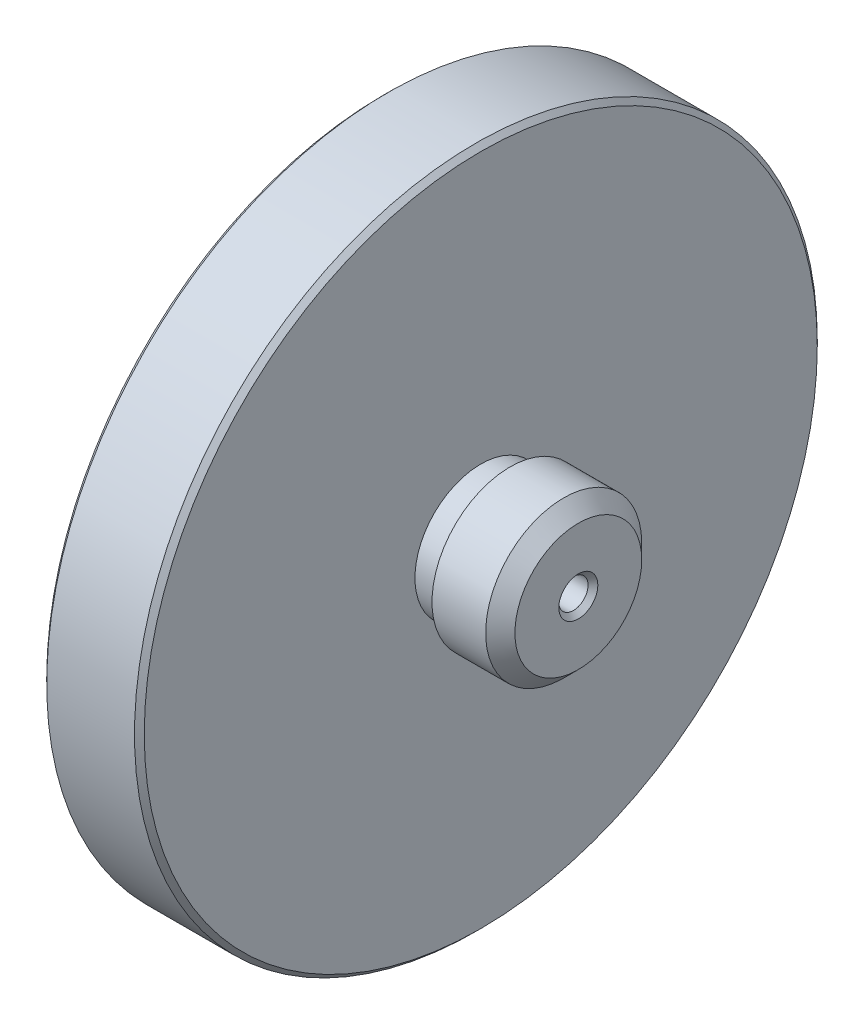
ISO-10303-21;
HEADER;
FILE_DESCRIPTION(('STEP AP214'),'2;1');
FILE_NAME('part.step','',(''),(''),'','','');
FILE_SCHEMA(('AUTOMOTIVE_DESIGN { 1 0 10303 214 1 1 1 1 }'));
ENDSEC;
DATA;
#1=APPLICATION_CONTEXT('core data for automotive mechanical design processes');
#2=APPLICATION_PROTOCOL_DEFINITION('international standard','automotive_design',2000,#1);
#3=PRODUCT_CONTEXT('',#1,'mechanical');
#4=PRODUCT('Part','Part','',(#3));
#5=PRODUCT_RELATED_PRODUCT_CATEGORY('part','',(#4));
#6=PRODUCT_DEFINITION_FORMATION('','',#4);
#7=PRODUCT_DEFINITION_CONTEXT('part definition',#1,'design');
#8=PRODUCT_DEFINITION('design','',#6,#7);
#9=PRODUCT_DEFINITION_SHAPE('','',#8);
#10=(LENGTH_UNIT() NAMED_UNIT(*) SI_UNIT(.MILLI.,.METRE.));
#11=(NAMED_UNIT(*) PLANE_ANGLE_UNIT() SI_UNIT($,.RADIAN.));
#12=(NAMED_UNIT(*) SI_UNIT($,.STERADIAN.) SOLID_ANGLE_UNIT());
#13=UNCERTAINTY_MEASURE_WITH_UNIT(LENGTH_MEASURE(1.E-05),#10,'distance_accuracy_value','');
#14=(GEOMETRIC_REPRESENTATION_CONTEXT(3) GLOBAL_UNCERTAINTY_ASSIGNED_CONTEXT((#13)) GLOBAL_UNIT_ASSIGNED_CONTEXT((#10,
#11,#12)) REPRESENTATION_CONTEXT('',''));
#15=CARTESIAN_POINT('',(0.,0.,0.));
#16=DIRECTION('',(0.,0.,1.));
#17=DIRECTION('',(1.,0.,0.));
#18=AXIS2_PLACEMENT_3D('',#15,#16,#17);
#19=CARTESIAN_POINT('',(0.,0.,0.));
#20=DIRECTION('',(1.,0.,0.));
#21=DIRECTION('',(0.,0.,-1.));
#22=AXIS2_PLACEMENT_3D('',#19,#20,#21);
#23=CYLINDRICAL_SURFACE('',#22,4.375);
#24=CARTESIAN_POINT('',(0.500000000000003,0.,0.));
#25=DIRECTION('',(1.,0.,0.));
#26=DIRECTION('',(0.,0.,-1.));
#27=AXIS2_PLACEMENT_3D('',#24,#25,#26);
#28=CIRCLE('',#27,4.375);
#29=CARTESIAN_POINT('',(0.500000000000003,0.,-4.375));
#30=VERTEX_POINT('',#29);
#31=EDGE_CURVE('E73',#30,#30,#28,.F.);
#32=ORIENTED_EDGE('',*,*,#31,.T.);
#33=EDGE_LOOP('',(#32));
#34=FACE_BOUND('',#33,.T.);
#35=CARTESIAN_POINT('',(16.,0.,0.));
#36=DIRECTION('',(1.,0.,0.));
#37=DIRECTION('',(0.,0.,-1.));
#38=AXIS2_PLACEMENT_3D('',#35,#36,#37);
#39=CIRCLE('',#38,4.375);
#40=CARTESIAN_POINT('',(16.,0.,-4.375));
#41=VERTEX_POINT('',#40);
#42=EDGE_CURVE('E50',#41,#41,#39,.F.);
#43=ORIENTED_EDGE('',*,*,#42,.F.);
#44=EDGE_LOOP('',(#43));
#45=FACE_BOUND('',#44,.T.);
#46=ADVANCED_FACE('F30',(#34,#45),#23,.F.);
#47=CARTESIAN_POINT('',(10.,0.,0.));
#48=DIRECTION('',(1.,0.,0.));
#49=DIRECTION('',(0.,0.,-1.));
#50=AXIS2_PLACEMENT_3D('',#47,#48,#49);
#51=PLANE('',#50);
#52=CARTESIAN_POINT('',(10.,0.,0.));
#53=DIRECTION('',(1.,0.,0.));
#54=DIRECTION('',(0.,0.,-1.));
#55=AXIS2_PLACEMENT_3D('',#52,#53,#54);
#56=CIRCLE('',#55,34.5);
#57=CARTESIAN_POINT('',(10.,0.,-34.5));
#58=VERTEX_POINT('',#57);
#59=EDGE_CURVE('E59',#58,#58,#56,.T.);
#60=ORIENTED_EDGE('',*,*,#59,.T.);
#61=EDGE_LOOP('',(#60));
#62=FACE_BOUND('',#61,.T.);
#63=CARTESIAN_POINT('',(10.,0.,0.));
#64=DIRECTION('',(1.,0.,0.));
#65=DIRECTION('',(0.,0.,-1.));
#66=AXIS2_PLACEMENT_3D('',#63,#64,#65);
#67=CIRCLE('',#66,6.75);
#68=CARTESIAN_POINT('',(10.,0.,-6.75));
#69=VERTEX_POINT('',#68);
#70=EDGE_CURVE('E81',#69,#69,#67,.T.);
#71=ORIENTED_EDGE('',*,*,#70,.F.);
#72=EDGE_LOOP('',(#71));
#73=FACE_BOUND('',#72,.T.);
#74=ADVANCED_FACE('F97',(#62,#73),#51,.T.);
#75=CARTESIAN_POINT('',(10.,0.,0.));
#76=DIRECTION('',(-1.,0.,0.));
#77=DIRECTION('',(0.,0.,1.));
#78=AXIS2_PLACEMENT_3D('',#75,#76,#77);
#79=CYLINDRICAL_SURFACE('',#78,35.);
#80=CARTESIAN_POINT('',(0.500000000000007,0.,0.));
#81=DIRECTION('',(1.,0.,0.));
#82=DIRECTION('',(0.,0.,-1.));
#83=AXIS2_PLACEMENT_3D('',#80,#81,#82);
#84=CIRCLE('',#83,35.);
#85=CARTESIAN_POINT('',(0.500000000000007,0.,-35.));
#86=VERTEX_POINT('',#85);
#87=EDGE_CURVE('E67',#86,#86,#84,.T.);
#88=ORIENTED_EDGE('',*,*,#87,.T.);
#89=EDGE_LOOP('',(#88));
#90=FACE_BOUND('',#89,.T.);
#91=CARTESIAN_POINT('',(9.49999999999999,0.,0.));
#92=DIRECTION('',(1.,0.,0.));
#93=DIRECTION('',(0.,0.,-1.));
#94=AXIS2_PLACEMENT_3D('',#91,#92,#93);
#95=CIRCLE('',#94,35.);
#96=CARTESIAN_POINT('',(9.49999999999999,0.,-35.));
#97=VERTEX_POINT('',#96);
#98=EDGE_CURVE('E70',#97,#97,#95,.F.);
#99=ORIENTED_EDGE('',*,*,#98,.T.);
#100=EDGE_LOOP('',(#99));
#101=FACE_BOUND('',#100,.T.);
#102=ADVANCED_FACE('F99',(#90,#101),#79,.T.);
#103=CARTESIAN_POINT('',(0.,0.,0.));
#104=DIRECTION('',(1.,0.,0.));
#105=DIRECTION('',(0.,0.,-1.));
#106=AXIS2_PLACEMENT_3D('',#103,#104,#105);
#107=PLANE('',#106);
#108=CARTESIAN_POINT('',(0.,0.,0.));
#109=DIRECTION('',(1.,0.,0.));
#110=DIRECTION('',(0.,0.,-1.));
#111=AXIS2_PLACEMENT_3D('',#108,#109,#110);
#112=CIRCLE('',#111,4.875);
#113=CARTESIAN_POINT('',(0.,0.,-4.875));
#114=VERTEX_POINT('',#113);
#115=EDGE_CURVE('E76',#114,#114,#112,.T.);
#116=ORIENTED_EDGE('',*,*,#115,.T.);
#117=EDGE_LOOP('',(#116));
#118=FACE_BOUND('',#117,.T.);
#119=CARTESIAN_POINT('',(0.,0.,0.));
#120=DIRECTION('',(1.,0.,0.));
#121=DIRECTION('',(0.,0.,-1.));
#122=AXIS2_PLACEMENT_3D('',#119,#120,#121);
#123=CIRCLE('',#122,34.5);
#124=CARTESIAN_POINT('',(0.,0.,-34.5));
#125=VERTEX_POINT('',#124);
#126=EDGE_CURVE('E63',#125,#125,#123,.F.);
#127=ORIENTED_EDGE('',*,*,#126,.T.);
#128=EDGE_LOOP('',(#127));
#129=FACE_BOUND('',#128,.T.);
#130=ADVANCED_FACE('F106',(#118,#129),#107,.F.);
#131=CARTESIAN_POINT('',(20.,0.,0.));
#132=DIRECTION('',(-1.,0.,0.));
#133=DIRECTION('',(0.,0.,1.));
#134=AXIS2_PLACEMENT_3D('',#131,#132,#133);
#135=CYLINDRICAL_SURFACE('',#134,8.);
#136=CARTESIAN_POINT('',(18.5,0.,0.));
#137=DIRECTION('',(1.,0.,0.));
#138=DIRECTION('',(0.,0.,-1.));
#139=AXIS2_PLACEMENT_3D('',#136,#137,#138);
#140=CIRCLE('',#139,8.);
#141=CARTESIAN_POINT('',(18.5,0.,-8.));
#142=VERTEX_POINT('',#141);
#143=EDGE_CURVE('E53',#142,#142,#140,.F.);
#144=ORIENTED_EDGE('',*,*,#143,.T.);
#145=EDGE_LOOP('',(#144));
#146=FACE_BOUND('',#145,.T.);
#147=CARTESIAN_POINT('',(13.,0.,0.));
#148=DIRECTION('',(1.,0.,0.));
#149=DIRECTION('',(0.,0.,-1.));
#150=AXIS2_PLACEMENT_3D('',#147,#148,#149);
#151=CIRCLE('',#150,8.);
#152=CARTESIAN_POINT('',(13.,0.,-8.));
#153=VERTEX_POINT('',#152);
#154=EDGE_CURVE('E60',#153,#153,#151,.T.);
#155=ORIENTED_EDGE('',*,*,#154,.T.);
#156=EDGE_LOOP('',(#155));
#157=FACE_BOUND('',#156,.T.);
#158=ADVANCED_FACE('F113',(#146,#157),#135,.T.);
#159=CARTESIAN_POINT('',(20.,0.,0.));
#160=DIRECTION('',(1.,0.,0.));
#161=DIRECTION('',(0.,0.,-1.));
#162=AXIS2_PLACEMENT_3D('',#159,#160,#161);
#163=PLANE('',#162);
#164=CARTESIAN_POINT('',(20.,0.,0.));
#165=DIRECTION('',(1.,0.,0.));
#166=DIRECTION('',(0.,0.,-1.));
#167=AXIS2_PLACEMENT_3D('',#164,#165,#166);
#168=CIRCLE('',#167,2.00000000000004);
#169=CARTESIAN_POINT('',(20.,0.,-2.00000000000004));
#170=VERTEX_POINT('',#169);
#171=EDGE_CURVE('E11',#170,#170,#168,.F.);
#172=ORIENTED_EDGE('',*,*,#171,.T.);
#173=EDGE_LOOP('',(#172));
#174=FACE_BOUND('',#173,.T.);
#175=CARTESIAN_POINT('',(20.,0.,0.));
#176=DIRECTION('',(1.,0.,0.));
#177=DIRECTION('',(0.,0.,-1.));
#178=AXIS2_PLACEMENT_3D('',#175,#176,#177);
#179=CIRCLE('',#178,6.50000000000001);
#180=CARTESIAN_POINT('',(20.,0.,-6.50000000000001));
#181=VERTEX_POINT('',#180);
#182=EDGE_CURVE('E56',#181,#181,#179,.T.);
#183=ORIENTED_EDGE('',*,*,#182,.T.);
#184=EDGE_LOOP('',(#183));
#185=FACE_BOUND('',#184,.T.);
#186=ADVANCED_FACE('F122',(#174,#185),#163,.T.);
#187=CARTESIAN_POINT('',(0.,0.,0.));
#188=DIRECTION('',(-1.,0.,0.));
#189=DIRECTION('',(0.,0.,1.));
#190=AXIS2_PLACEMENT_3D('',#187,#188,#189);
#191=CONICAL_SURFACE('',#190,4.875,0.785398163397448);
#192=ORIENTED_EDGE('',*,*,#31,.F.);
#193=EDGE_LOOP('',(#192));
#194=FACE_BOUND('',#193,.T.);
#195=ORIENTED_EDGE('',*,*,#115,.F.);
#196=EDGE_LOOP('',(#195));
#197=FACE_BOUND('',#196,.T.);
#198=ADVANCED_FACE('F118',(#194,#197),#191,.F.);
#199=CARTESIAN_POINT('',(0.500000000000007,0.,0.));
#200=DIRECTION('',(1.,0.,0.));
#201=DIRECTION('',(0.,0.,-1.));
#202=AXIS2_PLACEMENT_3D('',#199,#200,#201);
#203=CONICAL_SURFACE('',#202,35.,0.785398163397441);
#204=ORIENTED_EDGE('',*,*,#126,.F.);
#205=EDGE_LOOP('',(#204));
#206=FACE_BOUND('',#205,.T.);
#207=ORIENTED_EDGE('',*,*,#87,.F.);
#208=EDGE_LOOP('',(#207));
#209=FACE_BOUND('',#208,.T.);
#210=ADVANCED_FACE('F121',(#206,#209),#203,.T.);
#211=CARTESIAN_POINT('',(10.,0.,0.));
#212=DIRECTION('',(-1.,0.,0.));
#213=DIRECTION('',(0.,0.,1.));
#214=AXIS2_PLACEMENT_3D('',#211,#212,#213);
#215=CONICAL_SURFACE('',#214,34.5,0.785398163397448);
#216=ORIENTED_EDGE('',*,*,#98,.F.);
#217=EDGE_LOOP('',(#216));
#218=FACE_BOUND('',#217,.T.);
#219=ORIENTED_EDGE('',*,*,#59,.F.);
#220=EDGE_LOOP('',(#219));
#221=FACE_BOUND('',#220,.T.);
#222=ADVANCED_FACE('F126',(#218,#221),#215,.T.);
#223=CARTESIAN_POINT('',(13.,0.,0.));
#224=DIRECTION('',(1.,0.,0.));
#225=DIRECTION('',(0.,0.,-1.));
#226=AXIS2_PLACEMENT_3D('',#223,#224,#225);
#227=PLANE('',#226);
#228=CARTESIAN_POINT('',(13.,0.,0.));
#229=DIRECTION('',(1.,0.,0.));
#230=DIRECTION('',(0.,0.,-1.));
#231=AXIS2_PLACEMENT_3D('',#228,#229,#230);
#232=CIRCLE('',#231,6.75);
#233=CARTESIAN_POINT('',(13.,0.,-6.75));
#234=VERTEX_POINT('',#233);
#235=EDGE_CURVE('E64',#234,#234,#232,.T.);
#236=ORIENTED_EDGE('',*,*,#235,.T.);
#237=EDGE_LOOP('',(#236));
#238=FACE_BOUND('',#237,.T.);
#239=ORIENTED_EDGE('',*,*,#154,.F.);
#240=EDGE_LOOP('',(#239));
#241=FACE_BOUND('',#240,.T.);
#242=ADVANCED_FACE('F87',(#238,#241),#227,.F.);
#243=CARTESIAN_POINT('',(13.,0.,0.));
#244=DIRECTION('',(-1.,0.,0.));
#245=DIRECTION('',(0.,0.,1.));
#246=AXIS2_PLACEMENT_3D('',#243,#244,#245);
#247=CYLINDRICAL_SURFACE('',#246,6.75);
#248=ORIENTED_EDGE('',*,*,#235,.F.);
#249=EDGE_LOOP('',(#248));
#250=FACE_BOUND('',#249,.T.);
#251=ORIENTED_EDGE('',*,*,#70,.T.);
#252=EDGE_LOOP('',(#251));
#253=FACE_BOUND('',#252,.T.);
#254=ADVANCED_FACE('F90',(#250,#253),#247,.T.);
#255=CARTESIAN_POINT('',(20.,0.,0.));
#256=DIRECTION('',(-1.,0.,0.));
#257=DIRECTION('',(0.,0.,1.));
#258=AXIS2_PLACEMENT_3D('',#255,#256,#257);
#259=CONICAL_SURFACE('',#258,6.50000000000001,0.785398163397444);
#260=ORIENTED_EDGE('',*,*,#143,.F.);
#261=EDGE_LOOP('',(#260));
#262=FACE_BOUND('',#261,.T.);
#263=ORIENTED_EDGE('',*,*,#182,.F.);
#264=EDGE_LOOP('',(#263));
#265=FACE_BOUND('',#264,.T.);
#266=ADVANCED_FACE('F93',(#262,#265),#259,.T.);
#267=CARTESIAN_POINT('',(16.,0.,0.));
#268=DIRECTION('',(1.,0.,0.));
#269=DIRECTION('',(0.,0.,-1.));
#270=AXIS2_PLACEMENT_3D('',#267,#268,#269);
#271=PLANE('',#270);
#272=CARTESIAN_POINT('',(16.,0.,0.));
#273=DIRECTION('',(1.,0.,0.));
#274=DIRECTION('',(0.,0.,-1.));
#275=AXIS2_PLACEMENT_3D('',#272,#273,#274);
#276=CIRCLE('',#275,2.);
#277=CARTESIAN_POINT('',(16.,0.,-2.));
#278=VERTEX_POINT('',#277);
#279=EDGE_CURVE('E45',#278,#278,#276,.T.);
#280=ORIENTED_EDGE('',*,*,#279,.T.);
#281=EDGE_LOOP('',(#280));
#282=FACE_BOUND('',#281,.T.);
#283=ORIENTED_EDGE('',*,*,#42,.T.);
#284=EDGE_LOOP('',(#283));
#285=FACE_BOUND('',#284,.T.);
#286=ADVANCED_FACE('F132',(#282,#285),#271,.F.);
#287=CARTESIAN_POINT('',(16.,0.,0.));
#288=DIRECTION('',(1.,0.,0.));
#289=DIRECTION('',(0.,0.,-1.));
#290=AXIS2_PLACEMENT_3D('',#287,#288,#289);
#291=CYLINDRICAL_SURFACE('',#290,1.5);
#292=CARTESIAN_POINT('',(16.5,0.,0.));
#293=DIRECTION('',(1.,0.,0.));
#294=DIRECTION('',(0.,0.,-1.));
#295=AXIS2_PLACEMENT_3D('',#292,#293,#294);
#296=CIRCLE('',#295,1.5);
#297=CARTESIAN_POINT('',(16.5,0.,-1.5));
#298=VERTEX_POINT('',#297);
#299=EDGE_CURVE('E37',#298,#298,#296,.F.);
#300=ORIENTED_EDGE('',*,*,#299,.T.);
#301=EDGE_LOOP('',(#300));
#302=FACE_BOUND('',#301,.T.);
#303=CARTESIAN_POINT('',(19.5,0.,0.));
#304=DIRECTION('',(1.,0.,0.));
#305=DIRECTION('',(0.,0.,-1.));
#306=AXIS2_PLACEMENT_3D('',#303,#304,#305);
#307=CIRCLE('',#306,1.5);
#308=CARTESIAN_POINT('',(19.5,0.,-1.5));
#309=VERTEX_POINT('',#308);
#310=EDGE_CURVE('E41',#309,#309,#307,.T.);
#311=ORIENTED_EDGE('',*,*,#310,.T.);
#312=EDGE_LOOP('',(#311));
#313=FACE_BOUND('',#312,.T.);
#314=ADVANCED_FACE('F136',(#302,#313),#291,.F.);
#315=CARTESIAN_POINT('',(16.,0.,0.));
#316=DIRECTION('',(-1.,0.,0.));
#317=DIRECTION('',(0.,0.,1.));
#318=AXIS2_PLACEMENT_3D('',#315,#316,#317);
#319=CONICAL_SURFACE('',#318,2.,0.785398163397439);
#320=ORIENTED_EDGE('',*,*,#299,.F.);
#321=EDGE_LOOP('',(#320));
#322=FACE_BOUND('',#321,.T.);
#323=ORIENTED_EDGE('',*,*,#279,.F.);
#324=EDGE_LOOP('',(#323));
#325=FACE_BOUND('',#324,.T.);
#326=ADVANCED_FACE('F134',(#322,#325),#319,.F.);
#327=CARTESIAN_POINT('',(19.5,0.,0.));
#328=DIRECTION('',(1.,0.,0.));
#329=DIRECTION('',(0.,0.,-1.));
#330=AXIS2_PLACEMENT_3D('',#327,#328,#329);
#331=CONICAL_SURFACE('',#330,1.5,0.78539816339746);
#332=ORIENTED_EDGE('',*,*,#171,.F.);
#333=EDGE_LOOP('',(#332));
#334=FACE_BOUND('',#333,.T.);
#335=ORIENTED_EDGE('',*,*,#310,.F.);
#336=EDGE_LOOP('',(#335));
#337=FACE_BOUND('',#336,.T.);
#338=ADVANCED_FACE('F32',(#334,#337),#331,.F.);
#339=CLOSED_SHELL('',(#46,#74,#102,#130,#158,#186,#198,#210,#222,#242,#254,#266,#286,#314,#326,#338));
#340=MANIFOLD_SOLID_BREP('B2',#339);
#341=ADVANCED_BREP_SHAPE_REPRESENTATION('',(#18,#340),#14);
#342=SHAPE_DEFINITION_REPRESENTATION(#9,#341);
ENDSEC;
END-ISO-10303-21;
